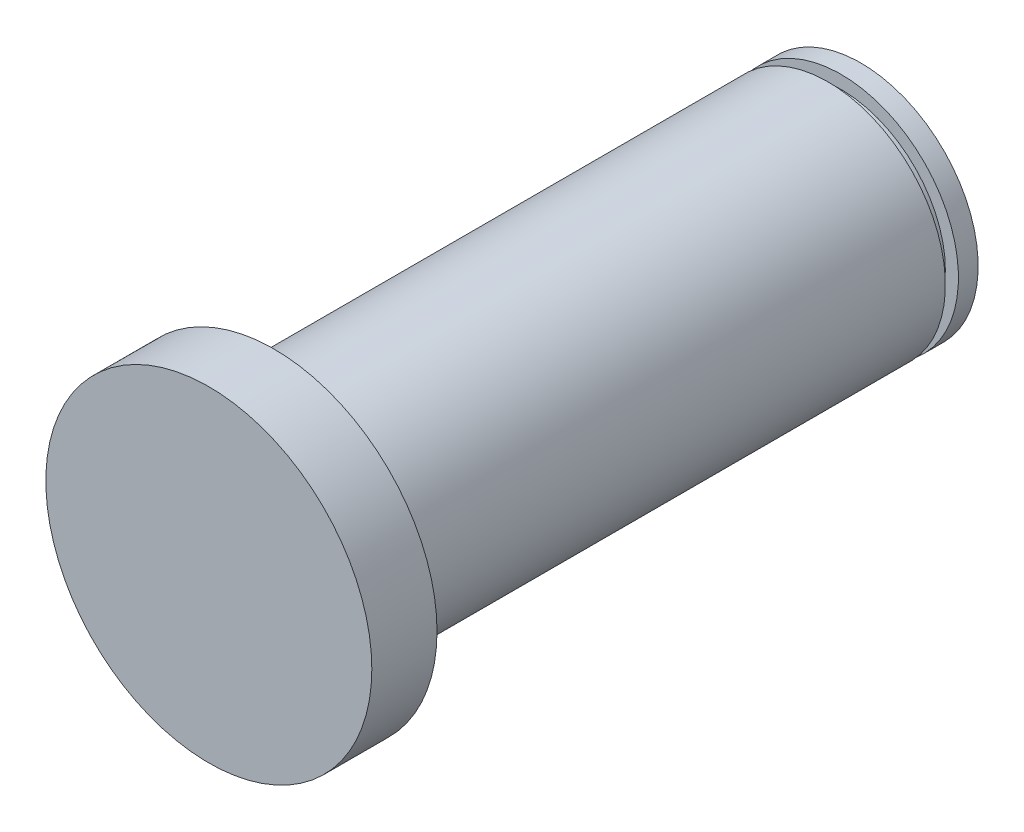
ISO-10303-21;
HEADER;
FILE_DESCRIPTION(('STEP AP214'),'2;1');
FILE_NAME('part.step','',(''),(''),'','','');
FILE_SCHEMA(('AUTOMOTIVE_DESIGN { 1 0 10303 214 1 1 1 1 }'));
ENDSEC;
DATA;
#1=APPLICATION_CONTEXT('core data for automotive mechanical design processes');
#2=APPLICATION_PROTOCOL_DEFINITION('international standard','automotive_design',2000,#1);
#3=PRODUCT_CONTEXT('',#1,'mechanical');
#4=PRODUCT('Part','Part','',(#3));
#5=PRODUCT_RELATED_PRODUCT_CATEGORY('part','',(#4));
#6=PRODUCT_DEFINITION_FORMATION('','',#4);
#7=PRODUCT_DEFINITION_CONTEXT('part definition',#1,'design');
#8=PRODUCT_DEFINITION('design','',#6,#7);
#9=PRODUCT_DEFINITION_SHAPE('','',#8);
#10=(LENGTH_UNIT() NAMED_UNIT(*) SI_UNIT(.MILLI.,.METRE.));
#11=(NAMED_UNIT(*) PLANE_ANGLE_UNIT() SI_UNIT($,.RADIAN.));
#12=(NAMED_UNIT(*) SI_UNIT($,.STERADIAN.) SOLID_ANGLE_UNIT());
#13=UNCERTAINTY_MEASURE_WITH_UNIT(LENGTH_MEASURE(1.E-05),#10,'distance_accuracy_value','');
#14=(GEOMETRIC_REPRESENTATION_CONTEXT(3) GLOBAL_UNCERTAINTY_ASSIGNED_CONTEXT((#13)) GLOBAL_UNIT_ASSIGNED_CONTEXT((#10,
#11,#12)) REPRESENTATION_CONTEXT('',''));
#15=CARTESIAN_POINT('',(0.,0.,0.));
#16=DIRECTION('',(0.,0.,1.));
#17=DIRECTION('',(1.,0.,0.));
#18=AXIS2_PLACEMENT_3D('',#15,#16,#17);
#19=CARTESIAN_POINT('',(0.,0.,45.));
#20=DIRECTION('',(0.,0.,-1.));
#21=DIRECTION('',(-1.,0.,0.));
#22=AXIS2_PLACEMENT_3D('',#19,#20,#21);
#23=CYLINDRICAL_SURFACE('',#22,9.);
#24=CARTESIAN_POINT('',(0.,0.,45.));
#25=DIRECTION('',(0.,0.,1.));
#26=DIRECTION('',(1.,0.,0.));
#27=AXIS2_PLACEMENT_3D('',#24,#25,#26);
#28=CIRCLE('',#27,9.);
#29=CARTESIAN_POINT('',(-9.,0.,45.));
#30=VERTEX_POINT('',#29);
#31=EDGE_CURVE('E10',#30,#30,#28,.T.);
#32=CARTESIAN_POINT('',(0.,0.,2.51378721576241));
#33=DIRECTION('',(0.,0.,1.));
#34=DIRECTION('',(1.,0.,0.));
#35=AXIS2_PLACEMENT_3D('',#32,#33,#34);
#36=CIRCLE('',#35,9.);
#37=CARTESIAN_POINT('',(-9.,0.,2.5137872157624));
#38=VERTEX_POINT('',#37);
#39=EDGE_CURVE('E59',#38,#38,#36,.T.);
#40=CARTESIAN_POINT('',(-9.,0.,45.));
#41=CARTESIAN_POINT('',(-9.,0.,44.5574352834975));
#42=CARTESIAN_POINT('',(-9.,0.,44.1148705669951));
#43=CARTESIAN_POINT('',(-9.,0.,43.2297411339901));
#44=CARTESIAN_POINT('',(-9.,0.,42.7871764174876));
#45=CARTESIAN_POINT('',(-9.,0.,41.9020469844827));
#46=CARTESIAN_POINT('',(-9.,0.,41.4594822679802));
#47=CARTESIAN_POINT('',(-9.,0.,40.5743528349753));
#48=CARTESIAN_POINT('',(-9.,0.,40.1317881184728));
#49=CARTESIAN_POINT('',(-9.,0.,39.2466586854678));
#50=CARTESIAN_POINT('',(-9.,0.,38.8040939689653));
#51=CARTESIAN_POINT('',(-9.,0.,37.9189645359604));
#52=CARTESIAN_POINT('',(-9.,0.,37.4763998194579));
#53=CARTESIAN_POINT('',(-9.,0.,36.591270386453));
#54=CARTESIAN_POINT('',(-9.,0.,36.1487056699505));
#55=CARTESIAN_POINT('',(-9.,0.,35.2635762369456));
#56=CARTESIAN_POINT('',(-9.,0.,34.8210115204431));
#57=CARTESIAN_POINT('',(-9.,0.,33.9358820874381));
#58=CARTESIAN_POINT('',(-9.,0.,33.4933173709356));
#59=CARTESIAN_POINT('',(-9.,0.,32.6081879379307));
#60=CARTESIAN_POINT('',(-9.,0.,32.1656232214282));
#61=CARTESIAN_POINT('',(-9.,0.,31.2804937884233));
#62=CARTESIAN_POINT('',(-9.,0.,30.8379290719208));
#63=CARTESIAN_POINT('',(-9.,0.,29.9527996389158));
#64=CARTESIAN_POINT('',(-9.,0.,29.5102349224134));
#65=CARTESIAN_POINT('',(-9.,0.,28.6251054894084));
#66=CARTESIAN_POINT('',(-9.,0.,28.1825407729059));
#67=CARTESIAN_POINT('',(-9.,0.,27.297411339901));
#68=CARTESIAN_POINT('',(-9.,0.,26.8548466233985));
#69=CARTESIAN_POINT('',(-9.,0.,25.9697171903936));
#70=CARTESIAN_POINT('',(-9.,0.,25.5271524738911));
#71=CARTESIAN_POINT('',(-9.,0.,24.6420230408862));
#72=CARTESIAN_POINT('',(-9.,0.,24.1994583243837));
#73=CARTESIAN_POINT('',(-9.,0.,23.3143288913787));
#74=CARTESIAN_POINT('',(-9.,0.,22.8717641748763));
#75=CARTESIAN_POINT('',(-9.,0.,21.9866347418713));
#76=CARTESIAN_POINT('',(-9.,0.,21.5440700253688));
#77=CARTESIAN_POINT('',(-9.,0.,20.6589405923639));
#78=CARTESIAN_POINT('',(-9.,0.,20.2163758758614));
#79=CARTESIAN_POINT('',(-9.,0.,19.3312464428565));
#80=CARTESIAN_POINT('',(-9.,0.,18.888681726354));
#81=CARTESIAN_POINT('',(-9.,0.,18.003552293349));
#82=CARTESIAN_POINT('',(-9.,0.,17.5609875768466));
#83=CARTESIAN_POINT('',(-9.,0.,16.6758581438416));
#84=CARTESIAN_POINT('',(-9.,0.,16.2332934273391));
#85=CARTESIAN_POINT('',(-9.,0.,15.3481639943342));
#86=CARTESIAN_POINT('',(-9.,0.,14.9055992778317));
#87=CARTESIAN_POINT('',(-9.,0.,14.0204698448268));
#88=CARTESIAN_POINT('',(-9.,0.,13.5779051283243));
#89=CARTESIAN_POINT('',(-9.,0.,12.6927756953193));
#90=CARTESIAN_POINT('',(-9.,0.,12.2502109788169));
#91=CARTESIAN_POINT('',(-9.,0.,11.3650815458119));
#92=CARTESIAN_POINT('',(-9.,0.,10.9225168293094));
#93=CARTESIAN_POINT('',(-9.,0.,10.0373873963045));
#94=CARTESIAN_POINT('',(-9.,0.,9.594822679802));
#95=CARTESIAN_POINT('',(-9.,0.,8.70969324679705));
#96=CARTESIAN_POINT('',(-9.,0.,8.26712853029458));
#97=CARTESIAN_POINT('',(-9.,0.,7.38199909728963));
#98=CARTESIAN_POINT('',(-9.,0.,6.93943438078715));
#99=CARTESIAN_POINT('',(-9.,0.,6.0543049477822));
#100=CARTESIAN_POINT('',(-9.,0.,5.61174023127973));
#101=CARTESIAN_POINT('',(-9.,0.,4.72661079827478));
#102=CARTESIAN_POINT('',(-9.,0.,4.2840460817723));
#103=CARTESIAN_POINT('',(-9.,0.,3.39891664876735));
#104=CARTESIAN_POINT('',(-9.,0.,2.95635193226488));
#105=CARTESIAN_POINT('',(-9.,0.,2.5137872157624));
#106=B_SPLINE_CURVE_WITH_KNOTS('',3,(#40,#41,#42,#43,#44,#45,#46,#47,#48,#49,#50,#51,#52,#53,
#54,#55,#56,#57,#58,#59,#60,#61,#62,#63,#64,#65,#66,#67,#68,#69,#70,#71,#72,#73,#74,#75,#76,#77,
#78,#79,#80,#81,#82,#83,#84,#85,#86,#87,#88,#89,#90,#91,#92,#93,#94,#95,#96,#97,#98,#99,#100,
#101,#102,#103,#104,#105),.UNSPECIFIED.,.F.,.F.,(4,2,2,2,2,2,2,2,2,2,2,2,2,2,2,2,2,2,2,2,2,2,2,
2,2,2,2,2,2,2,2,2,4),(0.,1.32769414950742,2.65538829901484,3.98308244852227,5.31077659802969,
6.63847074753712,7.96616489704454,9.29385904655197,10.6215531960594,11.9492473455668,
13.2769414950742,14.6046356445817,15.9323297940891,17.2600239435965,18.5877180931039,
19.9154122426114,21.2431063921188,22.5708005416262,23.8984946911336,25.2261888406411,
26.5538829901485,27.8815771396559,29.2092712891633,30.5369654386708,31.8646595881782,
33.1923537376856,34.520047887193,35.8477420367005,37.1754361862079,38.5031303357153,
39.8308244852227,41.1585186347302,42.4862127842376),.UNSPECIFIED.);
#107=EDGE_CURVE('BSEAM35',#30,#38,#106,.T.);
#108=ORIENTED_EDGE('',*,*,#31,.F.);
#109=ORIENTED_EDGE('',*,*,#39,.T.);
#110=ORIENTED_EDGE('',*,*,#107,.T.);
#111=ORIENTED_EDGE('',*,*,#107,.F.);
#112=EDGE_LOOP('',(#108,#110,#109,#111));
#113=FACE_BOUND('',#112,.T.);
#114=ADVANCED_FACE('F35',(#113),#23,.T.);
#115=CARTESIAN_POINT('',(0.,0.,50.));
#116=DIRECTION('',(0.,0.,-1.));
#117=DIRECTION('',(-1.,0.,0.));
#118=AXIS2_PLACEMENT_3D('',#115,#116,#117);
#119=CYLINDRICAL_SURFACE('',#118,12.5);
#120=CARTESIAN_POINT('',(0.,0.,50.));
#121=DIRECTION('',(0.,0.,1.));
#122=DIRECTION('',(1.,0.,0.));
#123=AXIS2_PLACEMENT_3D('',#120,#121,#122);
#124=CIRCLE('',#123,12.5);
#125=CARTESIAN_POINT('',(12.5,0.,50.));
#126=VERTEX_POINT('',#125);
#127=EDGE_CURVE('E46',#126,#126,#124,.T.);
#128=ORIENTED_EDGE('',*,*,#127,.F.);
#129=EDGE_LOOP('',(#128));
#130=FACE_BOUND('',#129,.T.);
#131=CARTESIAN_POINT('',(0.,0.,45.));
#132=DIRECTION('',(0.,0.,1.));
#133=DIRECTION('',(1.,0.,0.));
#134=AXIS2_PLACEMENT_3D('',#131,#132,#133);
#135=CIRCLE('',#134,12.5);
#136=CARTESIAN_POINT('',(12.5,0.,45.));
#137=VERTEX_POINT('',#136);
#138=EDGE_CURVE('E48',#137,#137,#135,.T.);
#139=ORIENTED_EDGE('',*,*,#138,.T.);
#140=EDGE_LOOP('',(#139));
#141=FACE_BOUND('',#140,.T.);
#142=ADVANCED_FACE('F79',(#130,#141),#119,.T.);
#143=CARTESIAN_POINT('',(0.,0.,50.));
#144=DIRECTION('',(0.,0.,1.));
#145=DIRECTION('',(1.,0.,0.));
#146=AXIS2_PLACEMENT_3D('',#143,#144,#145);
#147=PLANE('',#146);
#148=ORIENTED_EDGE('',*,*,#127,.T.);
#149=EDGE_LOOP('',(#148));
#150=FACE_BOUND('',#149,.T.);
#151=ADVANCED_FACE('F86',(#150),#147,.T.);
#152=CARTESIAN_POINT('',(0.,0.,45.));
#153=DIRECTION('',(0.,0.,1.));
#154=DIRECTION('',(1.,0.,0.));
#155=AXIS2_PLACEMENT_3D('',#152,#153,#154);
#156=PLANE('',#155);
#157=ORIENTED_EDGE('',*,*,#31,.T.);
#158=EDGE_LOOP('',(#157));
#159=FACE_BOUND('',#158,.T.);
#160=ORIENTED_EDGE('',*,*,#138,.F.);
#161=EDGE_LOOP('',(#160));
#162=FACE_BOUND('',#161,.T.);
#163=ADVANCED_FACE('F103',(#159,#162),#156,.F.);
#164=CARTESIAN_POINT('',(0.,9.,1.51378721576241));
#165=DIRECTION('',(0.,0.,1.));
#166=DIRECTION('',(1.,0.,0.));
#167=AXIS2_PLACEMENT_3D('',#164,#165,#166);
#168=PLANE('',#167);
#169=CARTESIAN_POINT('',(0.,0.,1.51378721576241));
#170=DIRECTION('',(0.,0.,1.));
#171=DIRECTION('',(1.,0.,0.));
#172=AXIS2_PLACEMENT_3D('',#169,#170,#171);
#173=CIRCLE('',#172,9.);
#174=CARTESIAN_POINT('',(-9.,0.,1.5137872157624));
#175=VERTEX_POINT('',#174);
#176=EDGE_CURVE('E62',#175,#175,#173,.T.);
#177=ORIENTED_EDGE('',*,*,#176,.T.);
#178=EDGE_LOOP('',(#177));
#179=FACE_BOUND('',#178,.T.);
#180=CARTESIAN_POINT('',(0.,0.,1.51378721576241));
#181=DIRECTION('',(0.,0.,1.));
#182=DIRECTION('',(1.,0.,0.));
#183=AXIS2_PLACEMENT_3D('',#180,#181,#182);
#184=CIRCLE('',#183,8.);
#185=CARTESIAN_POINT('',(8.,0.,1.51378721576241));
#186=VERTEX_POINT('',#185);
#187=EDGE_CURVE('E51',#186,#186,#184,.T.);
#188=ORIENTED_EDGE('',*,*,#187,.F.);
#189=EDGE_LOOP('',(#188));
#190=FACE_BOUND('',#189,.T.);
#191=ADVANCED_FACE('F66',(#179,#190),#168,.T.);
#192=CARTESIAN_POINT('',(0.,0.,45.));
#193=DIRECTION('',(0.,0.,1.));
#194=DIRECTION('',(1.,0.,0.));
#195=AXIS2_PLACEMENT_3D('',#192,#193,#194);
#196=CYLINDRICAL_SURFACE('',#195,8.);
#197=ORIENTED_EDGE('',*,*,#187,.T.);
#198=EDGE_LOOP('',(#197));
#199=FACE_BOUND('',#198,.T.);
#200=CARTESIAN_POINT('',(0.,0.,2.51378721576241));
#201=DIRECTION('',(0.,0.,1.));
#202=DIRECTION('',(1.,0.,0.));
#203=AXIS2_PLACEMENT_3D('',#200,#201,#202);
#204=CIRCLE('',#203,8.);
#205=CARTESIAN_POINT('',(8.,0.,2.51378721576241));
#206=VERTEX_POINT('',#205);
#207=EDGE_CURVE('E56',#206,#206,#204,.T.);
#208=ORIENTED_EDGE('',*,*,#207,.F.);
#209=EDGE_LOOP('',(#208));
#210=FACE_BOUND('',#209,.T.);
#211=ADVANCED_FACE('F93',(#199,#210),#196,.T.);
#212=CARTESIAN_POINT('',(0.,9.,2.51378721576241));
#213=DIRECTION('',(0.,0.,-1.));
#214=DIRECTION('',(-1.,0.,0.));
#215=AXIS2_PLACEMENT_3D('',#212,#213,#214);
#216=PLANE('',#215);
#217=ORIENTED_EDGE('',*,*,#207,.T.);
#218=EDGE_LOOP('',(#217));
#219=FACE_BOUND('',#218,.T.);
#220=ORIENTED_EDGE('',*,*,#39,.F.);
#221=EDGE_LOOP('',(#220));
#222=FACE_BOUND('',#221,.T.);
#223=ADVANCED_FACE('F76',(#219,#222),#216,.T.);
#224=CARTESIAN_POINT('',(0.,0.,0.));
#225=DIRECTION('',(0.,0.,1.));
#226=DIRECTION('',(1.,0.,0.));
#227=AXIS2_PLACEMENT_3D('',#224,#225,#226);
#228=PLANE('',#227);
#229=CARTESIAN_POINT('',(0.,0.,0.));
#230=DIRECTION('',(0.,0.,1.));
#231=DIRECTION('',(1.,0.,0.));
#232=AXIS2_PLACEMENT_3D('',#229,#230,#231);
#233=CIRCLE('',#232,9.);
#234=CARTESIAN_POINT('',(-9.,0.,0.));
#235=VERTEX_POINT('',#234);
#236=EDGE_CURVE('E39',#235,#235,#233,.T.);
#237=ORIENTED_EDGE('',*,*,#236,.F.);
#238=EDGE_LOOP('',(#237));
#239=FACE_BOUND('',#238,.T.);
#240=ADVANCED_FACE('F70',(#239),#228,.F.);
#241=CARTESIAN_POINT('',(-9.,0.,0.));
#242=CARTESIAN_POINT('',(-9.,0.,0.0157686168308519));
#243=CARTESIAN_POINT('',(-9.,0.,0.0315372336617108));
#244=CARTESIAN_POINT('',(-9.,0.,0.0630744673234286));
#245=CARTESIAN_POINT('',(-9.,0.,0.0788430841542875));
#246=CARTESIAN_POINT('',(-9.,0.,0.110380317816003));
#247=CARTESIAN_POINT('',(-9.,0.,0.126148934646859));
#248=CARTESIAN_POINT('',(-9.,0.,0.157686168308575));
#249=CARTESIAN_POINT('',(-9.,0.,0.173454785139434));
#250=CARTESIAN_POINT('',(-9.,0.,0.204992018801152));
#251=CARTESIAN_POINT('',(-9.,0.,0.22076063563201));
#252=CARTESIAN_POINT('',(-9.,0.,0.252297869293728));
#253=CARTESIAN_POINT('',(-9.,0.,0.268066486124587));
#254=CARTESIAN_POINT('',(-9.,0.,0.299603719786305));
#255=CARTESIAN_POINT('',(-9.,0.,0.315372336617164));
#256=CARTESIAN_POINT('',(-9.,0.,0.346909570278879));
#257=CARTESIAN_POINT('',(-9.,0.,0.362678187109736));
#258=CARTESIAN_POINT('',(-9.,0.,0.394215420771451));
#259=CARTESIAN_POINT('',(-9.,0.,0.40998403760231));
#260=CARTESIAN_POINT('',(-9.,0.,0.441521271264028));
#261=CARTESIAN_POINT('',(-9.,0.,0.457289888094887));
#262=CARTESIAN_POINT('',(-9.,0.,0.488827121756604));
#263=CARTESIAN_POINT('',(-9.,0.,0.504595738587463));
#264=CARTESIAN_POINT('',(-9.,0.,0.536132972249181));
#265=CARTESIAN_POINT('',(-9.,0.,0.55190158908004));
#266=CARTESIAN_POINT('',(-9.,0.,0.583438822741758));
#267=CARTESIAN_POINT('',(-9.,0.,0.599207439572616));
#268=CARTESIAN_POINT('',(-9.,0.,0.630744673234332));
#269=CARTESIAN_POINT('',(-9.,0.,0.646513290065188));
#270=CARTESIAN_POINT('',(-9.,0.,0.678050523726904));
#271=CARTESIAN_POINT('',(-9.,0.,0.693819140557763));
#272=CARTESIAN_POINT('',(-9.,0.,0.725356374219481));
#273=CARTESIAN_POINT('',(-9.,0.,0.741124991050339));
#274=CARTESIAN_POINT('',(-9.,0.,0.772662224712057));
#275=CARTESIAN_POINT('',(-9.,0.,0.788430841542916));
#276=CARTESIAN_POINT('',(-9.,0.,0.819968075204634));
#277=CARTESIAN_POINT('',(-9.,0.,0.835736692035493));
#278=CARTESIAN_POINT('',(-9.,0.,0.867273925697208));
#279=CARTESIAN_POINT('',(-9.,0.,0.883042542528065));
#280=CARTESIAN_POINT('',(-9.,0.,0.91457977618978));
#281=CARTESIAN_POINT('',(-9.,0.,0.930348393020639));
#282=CARTESIAN_POINT('',(-9.,0.,0.961885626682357));
#283=CARTESIAN_POINT('',(-9.,0.,0.977654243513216));
#284=CARTESIAN_POINT('',(-9.,0.,1.00919147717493));
#285=CARTESIAN_POINT('',(-9.,0.,1.02496009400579));
#286=CARTESIAN_POINT('',(-9.,0.,1.05649732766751));
#287=CARTESIAN_POINT('',(-9.,0.,1.07226594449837));
#288=CARTESIAN_POINT('',(-9.,0.,1.10380317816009));
#289=CARTESIAN_POINT('',(-9.,0.,1.11957179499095));
#290=CARTESIAN_POINT('',(-9.,0.,1.15110902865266));
#291=CARTESIAN_POINT('',(-9.,0.,1.16687764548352));
#292=CARTESIAN_POINT('',(-9.,0.,1.19841487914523));
#293=CARTESIAN_POINT('',(-9.,0.,1.21418349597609));
#294=CARTESIAN_POINT('',(-9.,0.,1.24572072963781));
#295=CARTESIAN_POINT('',(-9.,0.,1.26148934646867));
#296=CARTESIAN_POINT('',(-9.,0.,1.29302658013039));
#297=CARTESIAN_POINT('',(-9.,0.,1.30879519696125));
#298=CARTESIAN_POINT('',(-9.,0.,1.34033243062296));
#299=CARTESIAN_POINT('',(-9.,0.,1.35610104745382));
#300=CARTESIAN_POINT('',(-9.,0.,1.38763828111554));
#301=CARTESIAN_POINT('',(-9.,0.,1.40340689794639));
#302=CARTESIAN_POINT('',(-9.,0.,1.43494413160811));
#303=CARTESIAN_POINT('',(-9.,0.,1.45071274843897));
#304=CARTESIAN_POINT('',(-9.,0.,1.48224998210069));
#305=CARTESIAN_POINT('',(-9.,0.,1.49801859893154));
#306=CARTESIAN_POINT('',(-9.,0.,1.5137872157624));
#307=B_SPLINE_CURVE_WITH_KNOTS('',3,(#241,#242,#243,#244,#245,#246,#247,#248,#249,#250,#251,
#252,#253,#254,#255,#256,#257,#258,#259,#260,#261,#262,#263,#264,#265,#266,#267,#268,#269,#270,
#271,#272,#273,#274,#275,#276,#277,#278,#279,#280,#281,#282,#283,#284,#285,#286,#287,#288,#289,
#290,#291,#292,#293,#294,#295,#296,#297,#298,#299,#300,#301,#302,#303,#304,#305,#306),
.UNSPECIFIED.,.F.,.F.,(4,2,2,2,2,2,2,2,2,2,2,2,2,2,2,2,2,2,2,2,2,2,2,2,2,2,2,2,2,2,2,2,4),(0.,
0.0473058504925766,0.0946117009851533,0.141917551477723,0.1892234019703,0.236529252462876,
0.283835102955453,0.331140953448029,0.378446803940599,0.425752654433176,0.473058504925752,
0.520364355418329,0.567670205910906,0.614976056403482,0.662281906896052,0.709587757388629,
0.756893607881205,0.804199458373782,0.851505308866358,0.898811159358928,0.946117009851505,
0.993422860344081,1.04072871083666,1.08803456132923,1.13534041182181,1.18264626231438,
1.22995211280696,1.27725796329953,1.32456381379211,1.37186966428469,1.41917551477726,
1.46648136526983,1.51378721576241),.UNSPECIFIED.);
#308=EDGE_CURVE('BSEAM37',#235,#175,#307,.T.);
#309=ORIENTED_EDGE('',*,*,#236,.T.);
#310=ORIENTED_EDGE('',*,*,#176,.F.);
#311=ORIENTED_EDGE('',*,*,#308,.T.);
#312=ORIENTED_EDGE('',*,*,#308,.F.);
#313=EDGE_LOOP('',(#309,#311,#310,#312));
#314=FACE_BOUND('',#313,.T.);
#315=ADVANCED_FACE('F37',(#314),#23,.T.);
#316=CLOSED_SHELL('',(#114,#142,#151,#163,#191,#211,#223,#240,#315));
#317=MANIFOLD_SOLID_BREP('B2',#316);
#318=ADVANCED_BREP_SHAPE_REPRESENTATION('',(#18,#317),#14);
#319=SHAPE_DEFINITION_REPRESENTATION(#9,#318);
ENDSEC;
END-ISO-10303-21;
